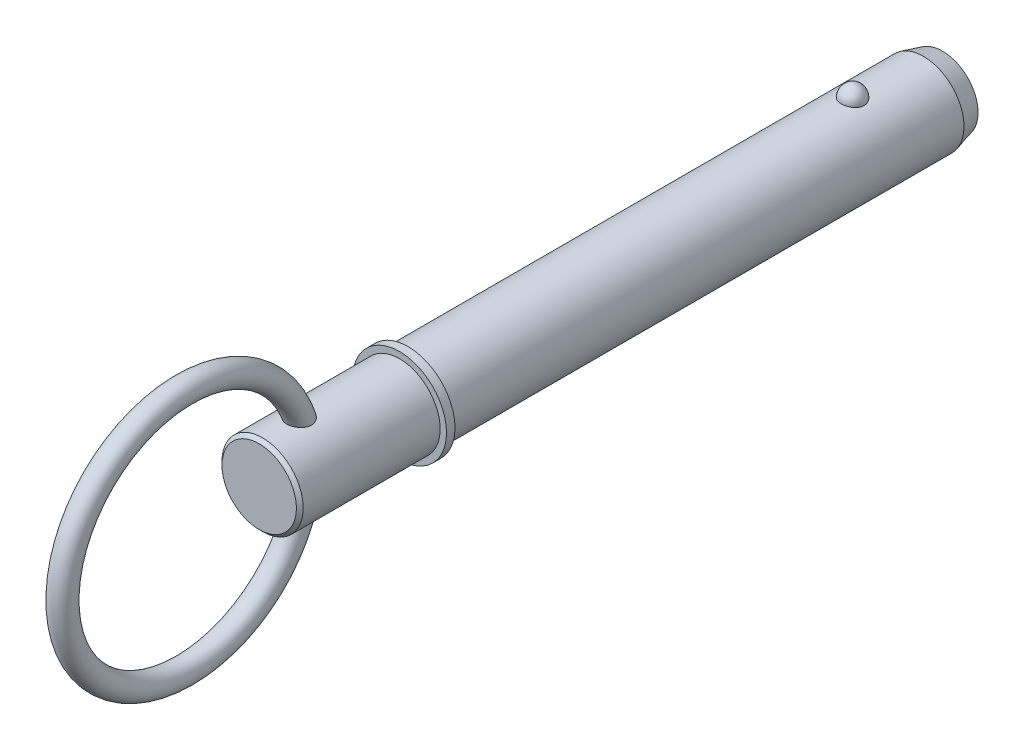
from build123d import *

# Parameters (mm, degrees)
SKETCH2_R           = 9.525
BOSS_EXTRUDE1_DEPTH = 101.6
BOSS_EXTRUDE2_START = 23.8
SKETCH3_R           = 9.525
BOSS_EXTRUDE2_DEPTH = 23.8
CHAMFER1_SIZE       = 4.5
CHAMFER1_SIZE2      = 1.205771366
SKETCH20_W          = 2
SKETCH20_H          = 11
SKETCH21_R          = 9.525
BOSS_EXTRUDE3_DEPTH = 34.93
CHAMFER2_SIZE       = 0.8
SKETCH24_R          = 2.75


with BuildPart() as part:
    # Sketch2 → Boss-Extrude1 (new body)
    with BuildSketch(Plane.XY):
        Circle(SKETCH2_R)
    extrude(amount=BOSS_EXTRUDE1_DEPTH)

    # Sketch3 → Boss-Extrude2 (add)
    with BuildSketch(Plane(origin=(0, 0, 0), x_dir=(-1, 0, 0), z_dir=(0, 0, -1)).offset(BOSS_EXTRUDE2_START)):
        Circle(SKETCH3_R)
    extrude(amount=-BOSS_EXTRUDE2_DEPTH)

    # Chamfer1
    chamfer1_edges = [part.edges().sort_by_distance(p)[0] for p in [
        (9.525, 0, -23.8),
    ]]
    chamfer1_side = [part.faces().sort_by_distance(p)[0] for p in [
        (9.525, 0, -11.9),
    ]]
    chamfer(chamfer1_edges, length=CHAMFER1_SIZE, length2=CHAMFER1_SIZE2, reference=chamfer1_side[0])

    # Sketch18 → Revolve1 (revolve)
    with BuildSketch(Plane(origin=(0, 0, 0), x_dir=(0, 0, -1), z_dir=(1, 0, 0))):
        with BuildLine():
            Line((2.69, 12.215), (2.69, 6.835))
            ThreePointArc((2.69, 6.835), (0, 9.525), (2.69, 12.215))
        make_face()
    revolve(axis=Axis((0, 12.215, -2.69), (0, -1, 0)))

    # Sketch20 → Revolve2 (revolve)
    with BuildSketch(Plane(origin=(0, 0, 0), x_dir=(0, 0, -1), z_dir=(1, 0, 0)), mode=Mode.PRIVATE) as revolve2_sk:
        with Locations((-102.6, 5.5)):
            Rectangle(SKETCH20_W, SKETCH20_H)
    revolve(revolve2_sk.sketch.rotate(Axis((0, 0, 33.728787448), (0, 0, 1)), 90), axis=Axis((0, 0, 33.728787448), (0, 0, 1)))

    # Sketch21 → Boss-Extrude3 (add)
    with BuildSketch(Plane(origin=(0, 0, 101.6), x_dir=(-1, 0, 0), z_dir=(0, 0, -1))):
        Circle(SKETCH21_R)
    extrude(amount=-BOSS_EXTRUDE3_DEPTH)

    # Chamfer2
    chamfer2_edges = [part.edges().sort_by_distance(p)[0] for p in [
        (9.525, 0, 136.53),
    ]]
    chamfer(chamfer2_edges, length=CHAMFER2_SIZE)

    # Sweep1: sweep along a path in Sketch23
    with BuildLine(Plane(origin=(0, 0, 0), x_dir=(0, 0, -1), z_dir=(1, 0, 0))) as sweep1_path:
        CenterArc((-154.105, 0), 28.575, 0, 360)
    # Sketch24 → Sweep1 (sweep)
    with BuildSketch(Plane(origin=(0, 0, 0), x_dir=(1, 0, 0), z_dir=(0, 1, 0))):
        with Locations((0, -125.53)):
            Circle(SKETCH24_R)
    sweep(path=sweep1_path.line)


solid = part.part
